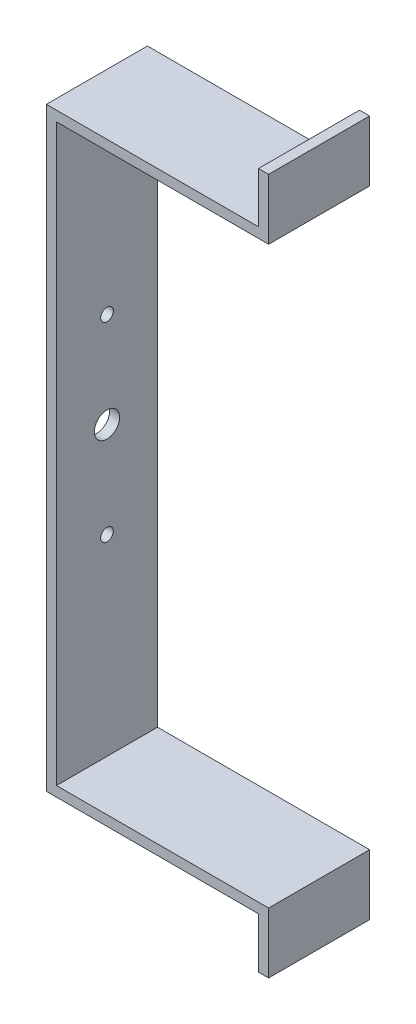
from build123d import *

# Parameters (mm, degrees)
BASE_EXTRUDE_THIN_DEPTH = 12.7
SKETCH2_R               = 3.175
CUT_EXTRUDE1_DEPTH      = 104.262871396
SKETCH3_R               = 1.587498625
CUT_EXTRUDE2_DEPTH      = 105.597511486
SKETCH4_R               = 1.587498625
CUT_EXTRUDE3_DEPTH      = 105.597511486


with BuildPart() as part:
    # Sketch1 → Base-Extrude-Thin (new, symmetric)
    with BuildSketch(Plane.XY):
        Polygon((53.34, 87.503), (53.34, 74.803), (0, 74.803), (0, -74.803), (53.34, -74.803), (53.34, -87.503), (55.88, -87.503), (55.88, -72.263), (2.54, -72.263), (2.54, 72.263), (55.88, 72.263), (55.88, 87.503), align=None)
    extrude(amount=BASE_EXTRUDE_THIN_DEPTH, both=True)

    # Sketch2 → Cut-Extrude1 (cut, through all)
    with BuildSketch(Plane(origin=(2.54, 0, 0), x_dir=(0, 0, -1), z_dir=(1, 0, 0))):
        with Locations(Location((0, 0, 0), (0, 0, 90))):
            Circle(SKETCH2_R)
    extrude(amount=-CUT_EXTRUDE1_DEPTH, mode=Mode.SUBTRACT)

    # Sketch3 → Cut-Extrude2 (cut, through all)
    with BuildSketch(Plane.ZY):
        with Locations(Location((0, 23.9776, 0), (0, 0, 270))):
            Circle(SKETCH3_R)
    extrude(amount=-CUT_EXTRUDE2_DEPTH, mode=Mode.SUBTRACT)

    # Sketch4 → Cut-Extrude3 (cut, through all)
    with BuildSketch(Plane.ZY):
        with Locations(Location((0, -23.9776, 0), (0, 0, 270))):
            Circle(SKETCH4_R)
    extrude(amount=-CUT_EXTRUDE3_DEPTH, mode=Mode.SUBTRACT)


solid = part.part
